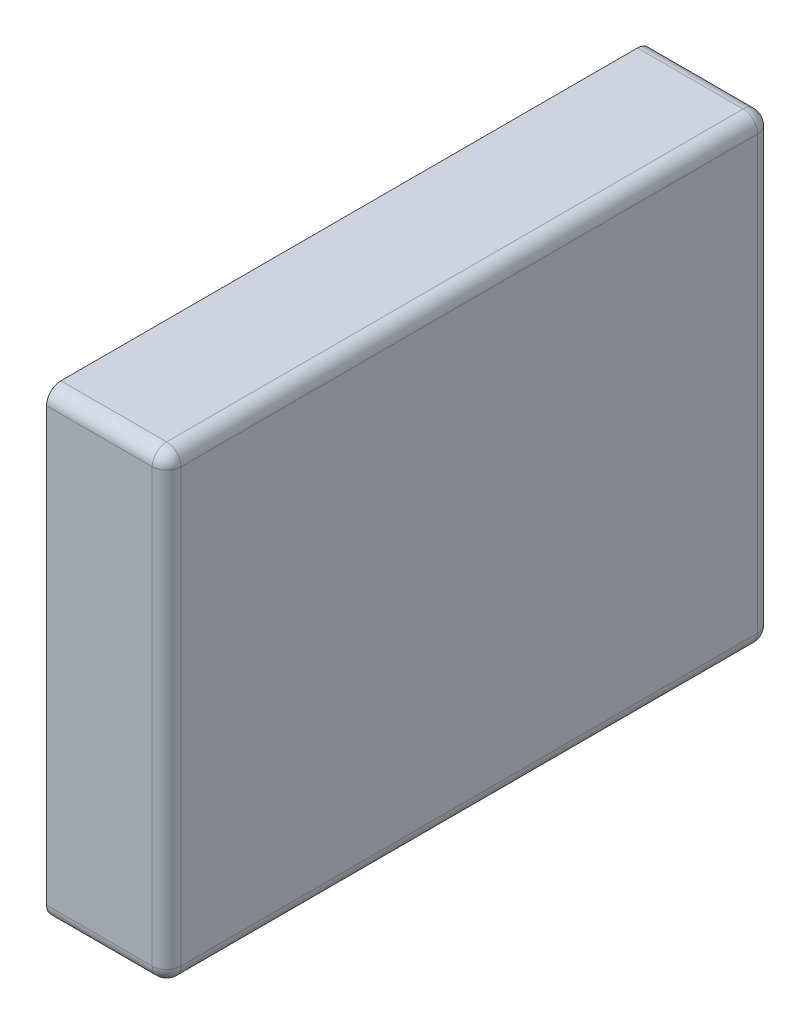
ISO-10303-21;
HEADER;
FILE_DESCRIPTION(('STEP AP214'),'2;1');
FILE_NAME('part.step','',(''),(''),'','','');
FILE_SCHEMA(('AUTOMOTIVE_DESIGN { 1 0 10303 214 1 1 1 1 }'));
ENDSEC;
DATA;
#1=APPLICATION_CONTEXT('core data for automotive mechanical design processes');
#2=APPLICATION_PROTOCOL_DEFINITION('international standard','automotive_design',2000,#1);
#3=PRODUCT_CONTEXT('',#1,'mechanical');
#4=PRODUCT('Part','Part','',(#3));
#5=PRODUCT_RELATED_PRODUCT_CATEGORY('part','',(#4));
#6=PRODUCT_DEFINITION_FORMATION('','',#4);
#7=PRODUCT_DEFINITION_CONTEXT('part definition',#1,'design');
#8=PRODUCT_DEFINITION('design','',#6,#7);
#9=PRODUCT_DEFINITION_SHAPE('','',#8);
#10=(LENGTH_UNIT() NAMED_UNIT(*) SI_UNIT(.MILLI.,.METRE.));
#11=(NAMED_UNIT(*) PLANE_ANGLE_UNIT() SI_UNIT($,.RADIAN.));
#12=(NAMED_UNIT(*) SI_UNIT($,.STERADIAN.) SOLID_ANGLE_UNIT());
#13=UNCERTAINTY_MEASURE_WITH_UNIT(LENGTH_MEASURE(1.E-05),#10,'distance_accuracy_value','');
#14=(GEOMETRIC_REPRESENTATION_CONTEXT(3) GLOBAL_UNCERTAINTY_ASSIGNED_CONTEXT((#13)) GLOBAL_UNIT_ASSIGNED_CONTEXT((#10,
#11,#12)) REPRESENTATION_CONTEXT('',''));
#15=CARTESIAN_POINT('',(0.,0.,0.));
#16=DIRECTION('',(0.,0.,1.));
#17=DIRECTION('',(1.,0.,0.));
#18=AXIS2_PLACEMENT_3D('',#15,#16,#17);
#19=CARTESIAN_POINT('',(25.,48.,-63.));
#20=DIRECTION('',(0.,0.,1.));
#21=DIRECTION('',(0.,-1.,0.));
#22=AXIS2_PLACEMENT_3D('',#19,#20,#21);
#23=PLANE('',#22);
#24=DIRECTION('',(0.,1.,0.));
#25=VECTOR('',#24,1.);
#26=CARTESIAN_POINT('',(22.,-45.,-63.));
#27=LINE('',#26,#25);
#28=CARTESIAN_POINT('',(22.,45.,-63.));
#29=VERTEX_POINT('',#28);
#30=CARTESIAN_POINT('',(22.,-45.,-63.));
#31=VERTEX_POINT('',#30);
#32=EDGE_CURVE('E273',#29,#31,#27,.F.);
#33=ORIENTED_EDGE('',*,*,#32,.T.);
#34=DIRECTION('',(-1.,0.,0.));
#35=VECTOR('',#34,1.);
#36=CARTESIAN_POINT('',(25.,-45.,-63.));
#37=LINE('',#36,#35);
#38=CARTESIAN_POINT('',(0.,-45.,-63.));
#39=VERTEX_POINT('',#38);
#40=EDGE_CURVE('E283',#31,#39,#37,.T.);
#41=ORIENTED_EDGE('',*,*,#40,.T.);
#42=DIRECTION('',(0.,1.,0.));
#43=VECTOR('',#42,1.);
#44=CARTESIAN_POINT('',(0.,48.,-63.));
#45=LINE('',#44,#43);
#46=CARTESIAN_POINT('',(0.,45.,-63.));
#47=VERTEX_POINT('',#46);
#48=EDGE_CURVE('E237',#39,#47,#45,.T.);
#49=ORIENTED_EDGE('',*,*,#48,.T.);
#50=DIRECTION('',(-1.,0.,0.));
#51=VECTOR('',#50,1.);
#52=CARTESIAN_POINT('',(25.,45.,-63.));
#53=LINE('',#52,#51);
#54=EDGE_CURVE('E281',#47,#29,#53,.F.);
#55=ORIENTED_EDGE('',*,*,#54,.T.);
#56=EDGE_LOOP('',(#33,#41,#49,#55));
#57=FACE_BOUND('',#56,.T.);
#58=ADVANCED_FACE('F35',(#57),#23,.F.);
#59=CARTESIAN_POINT('',(25.,48.,63.));
#60=DIRECTION('',(0.,-1.,0.));
#61=DIRECTION('',(0.,0.,-1.));
#62=AXIS2_PLACEMENT_3D('',#59,#60,#61);
#63=PLANE('',#62);
#64=DIRECTION('',(0.,0.,1.));
#65=VECTOR('',#64,1.);
#66=CARTESIAN_POINT('',(22.,48.,-63.));
#67=LINE('',#66,#65);
#68=CARTESIAN_POINT('',(22.,48.,60.));
#69=VERTEX_POINT('',#68);
#70=CARTESIAN_POINT('',(22.,48.,-60.));
#71=VERTEX_POINT('',#70);
#72=EDGE_CURVE('E247',#69,#71,#67,.F.);
#73=ORIENTED_EDGE('',*,*,#72,.T.);
#74=DIRECTION('',(-1.,0.,0.));
#75=VECTOR('',#74,1.);
#76=CARTESIAN_POINT('',(25.,48.,-60.));
#77=LINE('',#76,#75);
#78=CARTESIAN_POINT('',(0.,48.,-60.));
#79=VERTEX_POINT('',#78);
#80=EDGE_CURVE('E294',#71,#79,#77,.T.);
#81=ORIENTED_EDGE('',*,*,#80,.T.);
#82=DIRECTION('',(0.,0.,1.));
#83=VECTOR('',#82,1.);
#84=CARTESIAN_POINT('',(0.,48.,63.));
#85=LINE('',#84,#83);
#86=CARTESIAN_POINT('',(0.,48.,60.));
#87=VERTEX_POINT('',#86);
#88=EDGE_CURVE('E233',#79,#87,#85,.T.);
#89=ORIENTED_EDGE('',*,*,#88,.T.);
#90=DIRECTION('',(-1.,0.,0.));
#91=VECTOR('',#90,1.);
#92=CARTESIAN_POINT('',(25.,48.,60.));
#93=LINE('',#92,#91);
#94=EDGE_CURVE('E225',#87,#69,#93,.F.);
#95=ORIENTED_EDGE('',*,*,#94,.T.);
#96=EDGE_LOOP('',(#73,#81,#89,#95));
#97=FACE_BOUND('',#96,.T.);
#98=ADVANCED_FACE('F406',(#97),#63,.F.);
#99=CARTESIAN_POINT('',(25.,48.,63.));
#100=DIRECTION('',(0.,0.,-1.));
#101=DIRECTION('',(0.,1.,0.));
#102=AXIS2_PLACEMENT_3D('',#99,#100,#101);
#103=PLANE('',#102);
#104=DIRECTION('',(0.,-1.,0.));
#105=VECTOR('',#104,1.);
#106=CARTESIAN_POINT('',(0.,48.,63.));
#107=LINE('',#106,#105);
#108=CARTESIAN_POINT('',(0.,45.,63.));
#109=VERTEX_POINT('',#108);
#110=CARTESIAN_POINT('',(0.,-45.,63.));
#111=VERTEX_POINT('',#110);
#112=EDGE_CURVE('E212',#109,#111,#107,.T.);
#113=ORIENTED_EDGE('',*,*,#112,.T.);
#114=DIRECTION('',(-1.,0.,0.));
#115=VECTOR('',#114,1.);
#116=CARTESIAN_POINT('',(25.,-45.,63.));
#117=LINE('',#116,#115);
#118=CARTESIAN_POINT('',(22.,-45.,63.));
#119=VERTEX_POINT('',#118);
#120=EDGE_CURVE('E266',#111,#119,#117,.F.);
#121=ORIENTED_EDGE('',*,*,#120,.T.);
#122=DIRECTION('',(0.,-1.,0.));
#123=VECTOR('',#122,1.);
#124=CARTESIAN_POINT('',(22.,45.,63.));
#125=LINE('',#124,#123);
#126=CARTESIAN_POINT('',(22.,45.,63.));
#127=VERTEX_POINT('',#126);
#128=EDGE_CURVE('E215',#119,#127,#125,.F.);
#129=ORIENTED_EDGE('',*,*,#128,.T.);
#130=DIRECTION('',(-1.,0.,0.));
#131=VECTOR('',#130,1.);
#132=CARTESIAN_POINT('',(25.,45.,63.));
#133=LINE('',#132,#131);
#134=EDGE_CURVE('E208',#127,#109,#133,.T.);
#135=ORIENTED_EDGE('',*,*,#134,.T.);
#136=EDGE_LOOP('',(#113,#121,#129,#135));
#137=FACE_BOUND('',#136,.T.);
#138=ADVANCED_FACE('F210',(#137),#103,.F.);
#139=CARTESIAN_POINT('',(25.,-48.,63.));
#140=DIRECTION('',(0.,1.,0.));
#141=DIRECTION('',(0.,0.,1.));
#142=AXIS2_PLACEMENT_3D('',#139,#140,#141);
#143=PLANE('',#142);
#144=DIRECTION('',(0.,0.,-1.));
#145=VECTOR('',#144,1.);
#146=CARTESIAN_POINT('',(0.,-48.,63.));
#147=LINE('',#146,#145);
#148=CARTESIAN_POINT('',(0.,-48.,60.));
#149=VERTEX_POINT('',#148);
#150=CARTESIAN_POINT('',(0.,-48.,-60.));
#151=VERTEX_POINT('',#150);
#152=EDGE_CURVE('E219',#149,#151,#147,.T.);
#153=ORIENTED_EDGE('',*,*,#152,.T.);
#154=DIRECTION('',(-1.,0.,0.));
#155=VECTOR('',#154,1.);
#156=CARTESIAN_POINT('',(25.,-48.,-60.));
#157=LINE('',#156,#155);
#158=CARTESIAN_POINT('',(22.,-48.,-60.));
#159=VERTEX_POINT('',#158);
#160=EDGE_CURVE('E290',#151,#159,#157,.F.);
#161=ORIENTED_EDGE('',*,*,#160,.T.);
#162=DIRECTION('',(0.,0.,-1.));
#163=VECTOR('',#162,1.);
#164=CARTESIAN_POINT('',(22.,-48.,60.));
#165=LINE('',#164,#163);
#166=CARTESIAN_POINT('',(22.,-48.,60.));
#167=VERTEX_POINT('',#166);
#168=EDGE_CURVE('E253',#159,#167,#165,.F.);
#169=ORIENTED_EDGE('',*,*,#168,.T.);
#170=DIRECTION('',(-1.,0.,0.));
#171=VECTOR('',#170,1.);
#172=CARTESIAN_POINT('',(25.,-48.,60.));
#173=LINE('',#172,#171);
#174=EDGE_CURVE('E262',#167,#149,#173,.T.);
#175=ORIENTED_EDGE('',*,*,#174,.T.);
#176=EDGE_LOOP('',(#153,#161,#169,#175));
#177=FACE_BOUND('',#176,.T.);
#178=ADVANCED_FACE('F528',(#177),#143,.F.);
#179=CARTESIAN_POINT('',(25.,0.,0.));
#180=DIRECTION('',(1.,0.,0.));
#181=DIRECTION('',(0.,0.,-1.));
#182=AXIS2_PLACEMENT_3D('',#179,#180,#181);
#183=PLANE('',#182);
#184=DIRECTION('',(0.,0.,-1.));
#185=VECTOR('',#184,1.);
#186=CARTESIAN_POINT('',(25.,-45.,-63.));
#187=LINE('',#186,#185);
#188=CARTESIAN_POINT('',(25.,-45.,60.));
#189=VERTEX_POINT('',#188);
#190=CARTESIAN_POINT('',(25.,-45.,-60.));
#191=VERTEX_POINT('',#190);
#192=EDGE_CURVE('E270',#189,#191,#187,.T.);
#193=ORIENTED_EDGE('',*,*,#192,.T.);
#194=DIRECTION('',(0.,1.,0.));
#195=VECTOR('',#194,1.);
#196=CARTESIAN_POINT('',(25.,45.,-60.));
#197=LINE('',#196,#195);
#198=CARTESIAN_POINT('',(25.,45.,-60.));
#199=VERTEX_POINT('',#198);
#200=EDGE_CURVE('E298',#191,#199,#197,.T.);
#201=ORIENTED_EDGE('',*,*,#200,.T.);
#202=DIRECTION('',(0.,0.,1.));
#203=VECTOR('',#202,1.);
#204=CARTESIAN_POINT('',(25.,45.,60.));
#205=LINE('',#204,#203);
#206=CARTESIAN_POINT('',(25.,45.,60.));
#207=VERTEX_POINT('',#206);
#208=EDGE_CURVE('E245',#199,#207,#205,.T.);
#209=ORIENTED_EDGE('',*,*,#208,.T.);
#210=DIRECTION('',(0.,-1.,0.));
#211=VECTOR('',#210,1.);
#212=CARTESIAN_POINT('',(25.,-48.,60.));
#213=LINE('',#212,#211);
#214=EDGE_CURVE('E242',#207,#189,#213,.T.);
#215=ORIENTED_EDGE('',*,*,#214,.T.);
#216=EDGE_LOOP('',(#193,#201,#209,#215));
#217=FACE_BOUND('',#216,.T.);
#218=ADVANCED_FACE('F538',(#217),#183,.T.);
#219=CARTESIAN_POINT('',(0.,0.,0.));
#220=DIRECTION('',(1.,0.,0.));
#221=DIRECTION('',(0.,0.,-1.));
#222=AXIS2_PLACEMENT_3D('',#219,#220,#221);
#223=PLANE('',#222);
#224=DIRECTION('',(0.,0.,-1.));
#225=VECTOR('',#224,1.);
#226=CARTESIAN_POINT('',(0.,47.,-62.));
#227=LINE('',#226,#225);
#228=CARTESIAN_POINT('',(0.,47.,56.));
#229=VERTEX_POINT('',#228);
#230=CARTESIAN_POINT('',(0.,47.,-56.));
#231=VERTEX_POINT('',#230);
#232=EDGE_CURVE('E509',#229,#231,#227,.T.);
#233=ORIENTED_EDGE('',*,*,#232,.F.);
#234=CARTESIAN_POINT('',(0.,41.,56.));
#235=DIRECTION('',(1.,0.,0.));
#236=DIRECTION('',(0.,0.,-1.));
#237=AXIS2_PLACEMENT_3D('',#234,#235,#236);
#238=CIRCLE('',#237,6.);
#239=CARTESIAN_POINT('',(0.,41.,62.));
#240=VERTEX_POINT('',#239);
#241=EDGE_CURVE('E331',#229,#240,#238,.T.);
#242=ORIENTED_EDGE('',*,*,#241,.T.);
#243=DIRECTION('',(0.,1.,0.));
#244=VECTOR('',#243,1.);
#245=CARTESIAN_POINT('',(0.,47.,62.));
#246=LINE('',#245,#244);
#247=CARTESIAN_POINT('',(0.,-41.,62.));
#248=VERTEX_POINT('',#247);
#249=EDGE_CURVE('E507',#248,#240,#246,.T.);
#250=ORIENTED_EDGE('',*,*,#249,.F.);
#251=CARTESIAN_POINT('',(0.,-41.,56.));
#252=DIRECTION('',(1.,0.,0.));
#253=DIRECTION('',(0.,0.,-1.));
#254=AXIS2_PLACEMENT_3D('',#251,#252,#253);
#255=CIRCLE('',#254,6.);
#256=CARTESIAN_POINT('',(0.,-47.,56.));
#257=VERTEX_POINT('',#256);
#258=EDGE_CURVE('E371',#248,#257,#255,.T.);
#259=ORIENTED_EDGE('',*,*,#258,.T.);
#260=DIRECTION('',(0.,0.,1.));
#261=VECTOR('',#260,1.);
#262=CARTESIAN_POINT('',(0.,-47.,-62.));
#263=LINE('',#262,#261);
#264=CARTESIAN_POINT('',(0.,-47.,-56.));
#265=VERTEX_POINT('',#264);
#266=EDGE_CURVE('E496',#265,#257,#263,.T.);
#267=ORIENTED_EDGE('',*,*,#266,.F.);
#268=CARTESIAN_POINT('',(0.,-41.,-56.));
#269=DIRECTION('',(1.,0.,0.));
#270=DIRECTION('',(0.,0.,-1.));
#271=AXIS2_PLACEMENT_3D('',#268,#269,#270);
#272=CIRCLE('',#271,6.);
#273=CARTESIAN_POINT('',(0.,-41.,-62.));
#274=VERTEX_POINT('',#273);
#275=EDGE_CURVE('E11',#265,#274,#272,.T.);
#276=ORIENTED_EDGE('',*,*,#275,.T.);
#277=DIRECTION('',(0.,-1.,0.));
#278=VECTOR('',#277,1.);
#279=CARTESIAN_POINT('',(0.,47.,-62.));
#280=LINE('',#279,#278);
#281=CARTESIAN_POINT('',(0.,41.,-62.));
#282=VERTEX_POINT('',#281);
#283=EDGE_CURVE('E500',#282,#274,#280,.T.);
#284=ORIENTED_EDGE('',*,*,#283,.F.);
#285=CARTESIAN_POINT('',(0.,41.,-56.));
#286=DIRECTION('',(1.,0.,0.));
#287=DIRECTION('',(0.,0.,-1.));
#288=AXIS2_PLACEMENT_3D('',#285,#286,#287);
#289=CIRCLE('',#288,6.);
#290=EDGE_CURVE('E350',#282,#231,#289,.T.);
#291=ORIENTED_EDGE('',*,*,#290,.T.);
#292=EDGE_LOOP('',(#233,#242,#250,#259,#267,#276,#284,#291));
#293=FACE_BOUND('',#292,.T.);
#294=ORIENTED_EDGE('',*,*,#48,.F.);
#295=CARTESIAN_POINT('',(0.,-45.,-60.));
#296=DIRECTION('',(1.,0.,0.));
#297=DIRECTION('',(0.,0.,-1.));
#298=AXIS2_PLACEMENT_3D('',#295,#296,#297);
#299=CIRCLE('',#298,3.);
#300=EDGE_CURVE('E288',#39,#151,#299,.F.);
#301=ORIENTED_EDGE('',*,*,#300,.T.);
#302=ORIENTED_EDGE('',*,*,#152,.F.);
#303=CARTESIAN_POINT('',(0.,-45.,60.));
#304=DIRECTION('',(1.,0.,0.));
#305=DIRECTION('',(0.,0.,-1.));
#306=AXIS2_PLACEMENT_3D('',#303,#304,#305);
#307=CIRCLE('',#306,3.);
#308=EDGE_CURVE('E232',#149,#111,#307,.F.);
#309=ORIENTED_EDGE('',*,*,#308,.T.);
#310=ORIENTED_EDGE('',*,*,#112,.F.);
#311=CARTESIAN_POINT('',(0.,45.,60.));
#312=DIRECTION('',(1.,0.,0.));
#313=DIRECTION('',(0.,0.,-1.));
#314=AXIS2_PLACEMENT_3D('',#311,#312,#313);
#315=CIRCLE('',#314,3.);
#316=EDGE_CURVE('E218',#109,#87,#315,.F.);
#317=ORIENTED_EDGE('',*,*,#316,.T.);
#318=ORIENTED_EDGE('',*,*,#88,.F.);
#319=CARTESIAN_POINT('',(0.,45.,-60.));
#320=DIRECTION('',(1.,0.,0.));
#321=DIRECTION('',(0.,0.,-1.));
#322=AXIS2_PLACEMENT_3D('',#319,#320,#321);
#323=CIRCLE('',#322,3.);
#324=EDGE_CURVE('E286',#79,#47,#323,.F.);
#325=ORIENTED_EDGE('',*,*,#324,.T.);
#326=EDGE_LOOP('',(#294,#301,#302,#309,#310,#317,#318,#325));
#327=FACE_BOUND('',#326,.T.);
#328=ADVANCED_FACE('F230',(#293,#327),#223,.F.);
#329=CARTESIAN_POINT('',(25.,45.,60.));
#330=DIRECTION('',(-1.,0.,0.));
#331=DIRECTION('',(0.,0.,1.));
#332=AXIS2_PLACEMENT_3D('',#329,#330,#331);
#333=CYLINDRICAL_SURFACE('',#332,3.);
#334=ORIENTED_EDGE('',*,*,#134,.F.);
#335=CARTESIAN_POINT('',(22.,45.,60.));
#336=DIRECTION('',(-1.,0.,0.));
#337=DIRECTION('',(0.,0.,1.));
#338=AXIS2_PLACEMENT_3D('',#335,#336,#337);
#339=CIRCLE('',#338,3.);
#340=EDGE_CURVE('E250',#127,#69,#339,.T.);
#341=ORIENTED_EDGE('',*,*,#340,.T.);
#342=ORIENTED_EDGE('',*,*,#94,.F.);
#343=ORIENTED_EDGE('',*,*,#316,.F.);
#344=EDGE_LOOP('',(#334,#341,#342,#343));
#345=FACE_BOUND('',#344,.T.);
#346=ADVANCED_FACE('F223',(#345),#333,.T.);
#347=CARTESIAN_POINT('',(22.,0.,60.));
#348=DIRECTION('',(0.,1.,0.));
#349=DIRECTION('',(0.,0.,1.));
#350=AXIS2_PLACEMENT_3D('',#347,#348,#349);
#351=CYLINDRICAL_SURFACE('',#350,3.);
#352=ORIENTED_EDGE('',*,*,#128,.F.);
#353=CARTESIAN_POINT('',(22.,-45.,60.));
#354=DIRECTION('',(0.,1.,0.));
#355=DIRECTION('',(0.,0.,1.));
#356=AXIS2_PLACEMENT_3D('',#353,#354,#355);
#357=CIRCLE('',#356,3.);
#358=EDGE_CURVE('E268',#119,#189,#357,.T.);
#359=ORIENTED_EDGE('',*,*,#358,.T.);
#360=ORIENTED_EDGE('',*,*,#214,.F.);
#361=CARTESIAN_POINT('',(22.,45.,60.));
#362=DIRECTION('',(0.,1.,0.));
#363=DIRECTION('',(0.,0.,1.));
#364=AXIS2_PLACEMENT_3D('',#361,#362,#363);
#365=CIRCLE('',#364,3.);
#366=EDGE_CURVE('E257',#127,#207,#365,.T.);
#367=ORIENTED_EDGE('',*,*,#366,.F.);
#368=EDGE_LOOP('',(#352,#359,#360,#367));
#369=FACE_BOUND('',#368,.T.);
#370=ADVANCED_FACE('F418',(#369),#351,.T.);
#371=CARTESIAN_POINT('',(22.,45.,60.));
#372=DIRECTION('',(0.,0.,1.));
#373=DIRECTION('',(1.,0.,0.));
#374=AXIS2_PLACEMENT_3D('',#371,#372,#373);
#375=SPHERICAL_SURFACE('',#374,3.);
#376=ORIENTED_EDGE('',*,*,#340,.F.);
#377=ORIENTED_EDGE('',*,*,#366,.T.);
#378=CARTESIAN_POINT('',(22.,45.,60.));
#379=DIRECTION('',(0.,0.,-1.));
#380=DIRECTION('',(-1.,0.,0.));
#381=AXIS2_PLACEMENT_3D('',#378,#379,#380);
#382=CIRCLE('',#381,3.);
#383=EDGE_CURVE('E254',#69,#207,#382,.T.);
#384=ORIENTED_EDGE('',*,*,#383,.F.);
#385=EDGE_LOOP('',(#376,#377,#384));
#386=FACE_BOUND('',#385,.T.);
#387=ADVANCED_FACE('F423',(#386),#375,.T.);
#388=CARTESIAN_POINT('',(22.,45.,0.));
#389=DIRECTION('',(0.,0.,-1.));
#390=DIRECTION('',(-1.,0.,0.));
#391=AXIS2_PLACEMENT_3D('',#388,#389,#390);
#392=CYLINDRICAL_SURFACE('',#391,3.);
#393=ORIENTED_EDGE('',*,*,#208,.F.);
#394=CARTESIAN_POINT('',(22.,45.,-60.));
#395=DIRECTION('',(0.,0.,-1.));
#396=DIRECTION('',(-1.,0.,0.));
#397=AXIS2_PLACEMENT_3D('',#394,#395,#396);
#398=CIRCLE('',#397,3.);
#399=EDGE_CURVE('E296',#199,#71,#398,.F.);
#400=ORIENTED_EDGE('',*,*,#399,.T.);
#401=ORIENTED_EDGE('',*,*,#72,.F.);
#402=ORIENTED_EDGE('',*,*,#383,.T.);
#403=EDGE_LOOP('',(#393,#400,#401,#402));
#404=FACE_BOUND('',#403,.T.);
#405=ADVANCED_FACE('F419',(#404),#392,.T.);
#406=CARTESIAN_POINT('',(22.,-45.,0.));
#407=DIRECTION('',(0.,0.,1.));
#408=DIRECTION('',(1.,0.,0.));
#409=AXIS2_PLACEMENT_3D('',#406,#407,#408);
#410=CYLINDRICAL_SURFACE('',#409,3.);
#411=ORIENTED_EDGE('',*,*,#168,.F.);
#412=CARTESIAN_POINT('',(22.,-45.,-60.));
#413=DIRECTION('',(0.,0.,1.));
#414=DIRECTION('',(1.,0.,0.));
#415=AXIS2_PLACEMENT_3D('',#412,#413,#414);
#416=CIRCLE('',#415,3.);
#417=EDGE_CURVE('E292',#159,#191,#416,.T.);
#418=ORIENTED_EDGE('',*,*,#417,.T.);
#419=ORIENTED_EDGE('',*,*,#192,.F.);
#420=CARTESIAN_POINT('',(22.,-45.,60.));
#421=DIRECTION('',(0.,0.,1.));
#422=DIRECTION('',(1.,0.,0.));
#423=AXIS2_PLACEMENT_3D('',#420,#421,#422);
#424=CIRCLE('',#423,3.);
#425=EDGE_CURVE('E258',#167,#189,#424,.T.);
#426=ORIENTED_EDGE('',*,*,#425,.F.);
#427=EDGE_LOOP('',(#411,#418,#419,#426));
#428=FACE_BOUND('',#427,.T.);
#429=ADVANCED_FACE('F422',(#428),#410,.T.);
#430=CARTESIAN_POINT('',(22.,-45.,60.));
#431=DIRECTION('',(0.,0.,1.));
#432=DIRECTION('',(1.,0.,0.));
#433=AXIS2_PLACEMENT_3D('',#430,#431,#432);
#434=SPHERICAL_SURFACE('',#433,3.);
#435=ORIENTED_EDGE('',*,*,#425,.T.);
#436=ORIENTED_EDGE('',*,*,#358,.F.);
#437=CARTESIAN_POINT('',(22.,-45.,60.));
#438=DIRECTION('',(-1.,0.,0.));
#439=DIRECTION('',(0.,0.,1.));
#440=AXIS2_PLACEMENT_3D('',#437,#438,#439);
#441=CIRCLE('',#440,3.);
#442=EDGE_CURVE('E274',#167,#119,#441,.T.);
#443=ORIENTED_EDGE('',*,*,#442,.F.);
#444=EDGE_LOOP('',(#435,#436,#443));
#445=FACE_BOUND('',#444,.T.);
#446=ADVANCED_FACE('F435',(#445),#434,.T.);
#447=CARTESIAN_POINT('',(25.,-45.,60.));
#448=DIRECTION('',(-1.,0.,0.));
#449=DIRECTION('',(0.,0.,1.));
#450=AXIS2_PLACEMENT_3D('',#447,#448,#449);
#451=CYLINDRICAL_SURFACE('',#450,3.);
#452=ORIENTED_EDGE('',*,*,#442,.T.);
#453=ORIENTED_EDGE('',*,*,#120,.F.);
#454=ORIENTED_EDGE('',*,*,#308,.F.);
#455=ORIENTED_EDGE('',*,*,#174,.F.);
#456=EDGE_LOOP('',(#452,#453,#454,#455));
#457=FACE_BOUND('',#456,.T.);
#458=ADVANCED_FACE('F431',(#457),#451,.T.);
#459=CARTESIAN_POINT('',(25.,45.,-60.));
#460=DIRECTION('',(-1.,0.,0.));
#461=DIRECTION('',(0.,0.,1.));
#462=AXIS2_PLACEMENT_3D('',#459,#460,#461);
#463=CYLINDRICAL_SURFACE('',#462,3.);
#464=ORIENTED_EDGE('',*,*,#324,.F.);
#465=ORIENTED_EDGE('',*,*,#80,.F.);
#466=CARTESIAN_POINT('',(22.,45.,-60.));
#467=DIRECTION('',(1.,0.,0.));
#468=DIRECTION('',(0.,0.,-1.));
#469=AXIS2_PLACEMENT_3D('',#466,#467,#468);
#470=CIRCLE('',#469,3.);
#471=EDGE_CURVE('E277',#29,#71,#470,.T.);
#472=ORIENTED_EDGE('',*,*,#471,.F.);
#473=ORIENTED_EDGE('',*,*,#54,.F.);
#474=EDGE_LOOP('',(#464,#465,#472,#473));
#475=FACE_BOUND('',#474,.T.);
#476=ADVANCED_FACE('F434',(#475),#463,.T.);
#477=CARTESIAN_POINT('',(22.,45.,-60.));
#478=DIRECTION('',(0.,0.,1.));
#479=DIRECTION('',(1.,0.,0.));
#480=AXIS2_PLACEMENT_3D('',#477,#478,#479);
#481=SPHERICAL_SURFACE('',#480,3.);
#482=ORIENTED_EDGE('',*,*,#471,.T.);
#483=ORIENTED_EDGE('',*,*,#399,.F.);
#484=CARTESIAN_POINT('',(22.,45.,-60.));
#485=DIRECTION('',(0.,-1.,0.));
#486=DIRECTION('',(0.,0.,-1.));
#487=AXIS2_PLACEMENT_3D('',#484,#485,#486);
#488=CIRCLE('',#487,3.);
#489=EDGE_CURVE('E308',#29,#199,#488,.T.);
#490=ORIENTED_EDGE('',*,*,#489,.F.);
#491=EDGE_LOOP('',(#482,#483,#490));
#492=FACE_BOUND('',#491,.T.);
#493=ADVANCED_FACE('F455',(#492),#481,.T.);
#494=CARTESIAN_POINT('',(22.,0.,-60.));
#495=DIRECTION('',(0.,-1.,0.));
#496=DIRECTION('',(0.,0.,-1.));
#497=AXIS2_PLACEMENT_3D('',#494,#495,#496);
#498=CYLINDRICAL_SURFACE('',#497,3.);
#499=ORIENTED_EDGE('',*,*,#489,.T.);
#500=ORIENTED_EDGE('',*,*,#200,.F.);
#501=CARTESIAN_POINT('',(22.,-45.,-60.));
#502=DIRECTION('',(0.,-1.,0.));
#503=DIRECTION('',(0.,0.,-1.));
#504=AXIS2_PLACEMENT_3D('',#501,#502,#503);
#505=CIRCLE('',#504,3.);
#506=EDGE_CURVE('E304',#31,#191,#505,.T.);
#507=ORIENTED_EDGE('',*,*,#506,.F.);
#508=ORIENTED_EDGE('',*,*,#32,.F.);
#509=EDGE_LOOP('',(#499,#500,#507,#508));
#510=FACE_BOUND('',#509,.T.);
#511=ADVANCED_FACE('F451',(#510),#498,.T.);
#512=CARTESIAN_POINT('',(22.,-45.,-60.));
#513=DIRECTION('',(0.,0.,1.));
#514=DIRECTION('',(1.,0.,0.));
#515=AXIS2_PLACEMENT_3D('',#512,#513,#514);
#516=SPHERICAL_SURFACE('',#515,3.);
#517=ORIENTED_EDGE('',*,*,#506,.T.);
#518=ORIENTED_EDGE('',*,*,#417,.F.);
#519=CARTESIAN_POINT('',(22.,-45.,-60.));
#520=DIRECTION('',(-1.,0.,0.));
#521=DIRECTION('',(0.,0.,1.));
#522=AXIS2_PLACEMENT_3D('',#519,#520,#521);
#523=CIRCLE('',#522,3.);
#524=EDGE_CURVE('E301',#31,#159,#523,.T.);
#525=ORIENTED_EDGE('',*,*,#524,.F.);
#526=EDGE_LOOP('',(#517,#518,#525));
#527=FACE_BOUND('',#526,.T.);
#528=ADVANCED_FACE('F447',(#527),#516,.T.);
#529=CARTESIAN_POINT('',(25.,-45.,-60.));
#530=DIRECTION('',(-1.,0.,0.));
#531=DIRECTION('',(0.,0.,1.));
#532=AXIS2_PLACEMENT_3D('',#529,#530,#531);
#533=CYLINDRICAL_SURFACE('',#532,3.);
#534=ORIENTED_EDGE('',*,*,#524,.T.);
#535=ORIENTED_EDGE('',*,*,#160,.F.);
#536=ORIENTED_EDGE('',*,*,#300,.F.);
#537=ORIENTED_EDGE('',*,*,#40,.F.);
#538=EDGE_LOOP('',(#534,#535,#536,#537));
#539=FACE_BOUND('',#538,.T.);
#540=ADVANCED_FACE('F443',(#539),#533,.T.);
#541=CARTESIAN_POINT('',(1.,47.,62.));
#542=DIRECTION('',(0.,0.,1.));
#543=DIRECTION('',(1.,0.,0.));
#544=AXIS2_PLACEMENT_3D('',#541,#542,#543);
#545=PLANE('',#544);
#546=DIRECTION('',(0.,1.,0.));
#547=VECTOR('',#546,1.);
#548=CARTESIAN_POINT('',(1.,47.,62.));
#549=LINE('',#548,#547);
#550=CARTESIAN_POINT('',(1.,-41.,62.));
#551=VERTEX_POINT('',#550);
#552=CARTESIAN_POINT('',(1.,41.,62.));
#553=VERTEX_POINT('',#552);
#554=EDGE_CURVE('E490',#551,#553,#549,.T.);
#555=ORIENTED_EDGE('',*,*,#554,.F.);
#556=DIRECTION('',(-1.,0.,0.));
#557=VECTOR('',#556,1.);
#558=CARTESIAN_POINT('',(0.,-41.,62.));
#559=LINE('',#558,#557);
#560=EDGE_CURVE('E363',#551,#248,#559,.T.);
#561=ORIENTED_EDGE('',*,*,#560,.T.);
#562=ORIENTED_EDGE('',*,*,#249,.T.);
#563=DIRECTION('',(-1.,0.,0.));
#564=VECTOR('',#563,1.);
#565=CARTESIAN_POINT('',(1.,41.,62.));
#566=LINE('',#565,#564);
#567=EDGE_CURVE('E326',#240,#553,#566,.F.);
#568=ORIENTED_EDGE('',*,*,#567,.T.);
#569=EDGE_LOOP('',(#555,#561,#562,#568));
#570=FACE_BOUND('',#569,.T.);
#571=ADVANCED_FACE('F446',(#570),#545,.F.);
#572=CARTESIAN_POINT('',(1.,-47.,-62.));
#573=DIRECTION('',(0.,-1.,0.));
#574=DIRECTION('',(0.,0.,-1.));
#575=AXIS2_PLACEMENT_3D('',#572,#573,#574);
#576=PLANE('',#575);
#577=DIRECTION('',(0.,0.,1.));
#578=VECTOR('',#577,1.);
#579=CARTESIAN_POINT('',(1.,-47.,-62.));
#580=LINE('',#579,#578);
#581=CARTESIAN_POINT('',(1.,-47.,-56.));
#582=VERTEX_POINT('',#581);
#583=CARTESIAN_POINT('',(1.,-47.,56.));
#584=VERTEX_POINT('',#583);
#585=EDGE_CURVE('E305',#582,#584,#580,.T.);
#586=ORIENTED_EDGE('',*,*,#585,.F.);
#587=DIRECTION('',(-1.,0.,0.));
#588=VECTOR('',#587,1.);
#589=CARTESIAN_POINT('',(0.,-47.,-56.));
#590=LINE('',#589,#588);
#591=EDGE_CURVE('E383',#582,#265,#590,.T.);
#592=ORIENTED_EDGE('',*,*,#591,.T.);
#593=ORIENTED_EDGE('',*,*,#266,.T.);
#594=DIRECTION('',(-1.,0.,0.));
#595=VECTOR('',#594,1.);
#596=CARTESIAN_POINT('',(1.,-47.,56.));
#597=LINE('',#596,#595);
#598=EDGE_CURVE('E366',#257,#584,#597,.F.);
#599=ORIENTED_EDGE('',*,*,#598,.T.);
#600=EDGE_LOOP('',(#586,#592,#593,#599));
#601=FACE_BOUND('',#600,.T.);
#602=ADVANCED_FACE('F394',(#601),#576,.F.);
#603=CARTESIAN_POINT('',(1.,47.,-62.));
#604=DIRECTION('',(0.,0.,-1.));
#605=DIRECTION('',(-1.,0.,0.));
#606=AXIS2_PLACEMENT_3D('',#603,#604,#605);
#607=PLANE('',#606);
#608=ORIENTED_EDGE('',*,*,#283,.T.);
#609=DIRECTION('',(-1.,0.,0.));
#610=VECTOR('',#609,1.);
#611=CARTESIAN_POINT('',(1.,-41.,-62.));
#612=LINE('',#611,#610);
#613=CARTESIAN_POINT('',(1.,-41.,-62.));
#614=VERTEX_POINT('',#613);
#615=EDGE_CURVE('E55',#274,#614,#612,.F.);
#616=ORIENTED_EDGE('',*,*,#615,.T.);
#617=DIRECTION('',(0.,-1.,0.));
#618=VECTOR('',#617,1.);
#619=CARTESIAN_POINT('',(1.,47.,-62.));
#620=LINE('',#619,#618);
#621=CARTESIAN_POINT('',(1.,41.,-62.));
#622=VERTEX_POINT('',#621);
#623=EDGE_CURVE('E390',#622,#614,#620,.T.);
#624=ORIENTED_EDGE('',*,*,#623,.F.);
#625=DIRECTION('',(-1.,0.,0.));
#626=VECTOR('',#625,1.);
#627=CARTESIAN_POINT('',(0.,41.,-62.));
#628=LINE('',#627,#626);
#629=EDGE_CURVE('E343',#622,#282,#628,.T.);
#630=ORIENTED_EDGE('',*,*,#629,.T.);
#631=EDGE_LOOP('',(#608,#616,#624,#630));
#632=FACE_BOUND('',#631,.T.);
#633=ADVANCED_FACE('F663',(#632),#607,.F.);
#634=CARTESIAN_POINT('',(1.,47.,-62.));
#635=DIRECTION('',(0.,1.,0.));
#636=DIRECTION('',(0.,0.,1.));
#637=AXIS2_PLACEMENT_3D('',#634,#635,#636);
#638=PLANE('',#637);
#639=ORIENTED_EDGE('',*,*,#232,.T.);
#640=DIRECTION('',(-1.,0.,0.));
#641=VECTOR('',#640,1.);
#642=CARTESIAN_POINT('',(1.,47.,-56.));
#643=LINE('',#642,#641);
#644=CARTESIAN_POINT('',(1.,47.,-56.));
#645=VERTEX_POINT('',#644);
#646=EDGE_CURVE('E346',#231,#645,#643,.F.);
#647=ORIENTED_EDGE('',*,*,#646,.T.);
#648=DIRECTION('',(0.,0.,-1.));
#649=VECTOR('',#648,1.);
#650=CARTESIAN_POINT('',(1.,47.,-62.));
#651=LINE('',#650,#649);
#652=CARTESIAN_POINT('',(1.,47.,56.));
#653=VERTEX_POINT('',#652);
#654=EDGE_CURVE('E495',#653,#645,#651,.T.);
#655=ORIENTED_EDGE('',*,*,#654,.F.);
#656=DIRECTION('',(-1.,0.,0.));
#657=VECTOR('',#656,1.);
#658=CARTESIAN_POINT('',(0.,47.,56.));
#659=LINE('',#658,#657);
#660=EDGE_CURVE('E323',#653,#229,#659,.T.);
#661=ORIENTED_EDGE('',*,*,#660,.T.);
#662=EDGE_LOOP('',(#639,#647,#655,#661));
#663=FACE_BOUND('',#662,.T.);
#664=ADVANCED_FACE('F658',(#663),#638,.F.);
#665=CARTESIAN_POINT('',(1.,0.,0.));
#666=DIRECTION('',(-1.,0.,0.));
#667=DIRECTION('',(0.,0.,1.));
#668=AXIS2_PLACEMENT_3D('',#665,#666,#667);
#669=PLANE('',#668);
#670=DIRECTION('',(0.,1.,0.));
#671=VECTOR('',#670,1.);
#672=CARTESIAN_POINT('',(1.,46.,61.));
#673=LINE('',#672,#671);
#674=CARTESIAN_POINT('',(1.,-40.,61.));
#675=VERTEX_POINT('',#674);
#676=CARTESIAN_POINT('',(1.,40.,61.));
#677=VERTEX_POINT('',#676);
#678=EDGE_CURVE('E763',#675,#677,#673,.T.);
#679=ORIENTED_EDGE('',*,*,#678,.F.);
#680=CARTESIAN_POINT('',(1.,-40.,55.));
#681=DIRECTION('',(-1.,0.,0.));
#682=DIRECTION('',(0.,0.,1.));
#683=AXIS2_PLACEMENT_3D('',#680,#681,#682);
#684=CIRCLE('',#683,6.);
#685=CARTESIAN_POINT('',(1.,-46.,55.));
#686=VERTEX_POINT('',#685);
#687=EDGE_CURVE('E360',#675,#686,#684,.F.);
#688=ORIENTED_EDGE('',*,*,#687,.T.);
#689=DIRECTION('',(0.,0.,1.));
#690=VECTOR('',#689,1.);
#691=CARTESIAN_POINT('',(1.,-46.,-61.));
#692=LINE('',#691,#690);
#693=CARTESIAN_POINT('',(1.,-46.,-55.));
#694=VERTEX_POINT('',#693);
#695=EDGE_CURVE('E503',#694,#686,#692,.T.);
#696=ORIENTED_EDGE('',*,*,#695,.F.);
#697=CARTESIAN_POINT('',(1.,-40.,-55.));
#698=DIRECTION('',(-1.,0.,0.));
#699=DIRECTION('',(0.,0.,1.));
#700=AXIS2_PLACEMENT_3D('',#697,#698,#699);
#701=CIRCLE('',#700,6.);
#702=CARTESIAN_POINT('',(1.,-40.,-61.));
#703=VERTEX_POINT('',#702);
#704=EDGE_CURVE('E381',#694,#703,#701,.F.);
#705=ORIENTED_EDGE('',*,*,#704,.T.);
#706=DIRECTION('',(0.,-1.,0.));
#707=VECTOR('',#706,1.);
#708=CARTESIAN_POINT('',(1.,46.,-61.));
#709=LINE('',#708,#707);
#710=CARTESIAN_POINT('',(1.,40.,-61.));
#711=VERTEX_POINT('',#710);
#712=EDGE_CURVE('E771',#711,#703,#709,.T.);
#713=ORIENTED_EDGE('',*,*,#712,.F.);
#714=CARTESIAN_POINT('',(1.,40.,-55.));
#715=DIRECTION('',(-1.,0.,0.));
#716=DIRECTION('',(0.,0.,1.));
#717=AXIS2_PLACEMENT_3D('',#714,#715,#716);
#718=CIRCLE('',#717,6.);
#719=CARTESIAN_POINT('',(1.,46.,-55.));
#720=VERTEX_POINT('',#719);
#721=EDGE_CURVE('E341',#711,#720,#718,.F.);
#722=ORIENTED_EDGE('',*,*,#721,.T.);
#723=DIRECTION('',(0.,0.,-1.));
#724=VECTOR('',#723,1.);
#725=CARTESIAN_POINT('',(1.,46.,-61.));
#726=LINE('',#725,#724);
#727=CARTESIAN_POINT('',(1.,46.,55.));
#728=VERTEX_POINT('',#727);
#729=EDGE_CURVE('E768',#728,#720,#726,.T.);
#730=ORIENTED_EDGE('',*,*,#729,.F.);
#731=CARTESIAN_POINT('',(1.,40.,55.));
#732=DIRECTION('',(-1.,0.,0.));
#733=DIRECTION('',(0.,0.,1.));
#734=AXIS2_PLACEMENT_3D('',#731,#732,#733);
#735=CIRCLE('',#734,6.);
#736=EDGE_CURVE('E320',#728,#677,#735,.F.);
#737=ORIENTED_EDGE('',*,*,#736,.T.);
#738=EDGE_LOOP('',(#679,#688,#696,#705,#713,#722,#730,#737));
#739=FACE_BOUND('',#738,.T.);
#740=ORIENTED_EDGE('',*,*,#623,.T.);
#741=CARTESIAN_POINT('',(1.,-41.,-56.));
#742=DIRECTION('',(-1.,0.,0.));
#743=DIRECTION('',(0.,0.,1.));
#744=AXIS2_PLACEMENT_3D('',#741,#742,#743);
#745=CIRCLE('',#744,6.);
#746=EDGE_CURVE('E43',#614,#582,#745,.T.);
#747=ORIENTED_EDGE('',*,*,#746,.T.);
#748=ORIENTED_EDGE('',*,*,#585,.T.);
#749=CARTESIAN_POINT('',(1.,-41.,56.));
#750=DIRECTION('',(-1.,0.,0.));
#751=DIRECTION('',(0.,0.,1.));
#752=AXIS2_PLACEMENT_3D('',#749,#750,#751);
#753=CIRCLE('',#752,6.);
#754=EDGE_CURVE('E369',#584,#551,#753,.T.);
#755=ORIENTED_EDGE('',*,*,#754,.T.);
#756=ORIENTED_EDGE('',*,*,#554,.T.);
#757=CARTESIAN_POINT('',(1.,41.,56.));
#758=DIRECTION('',(-1.,0.,0.));
#759=DIRECTION('',(0.,0.,1.));
#760=AXIS2_PLACEMENT_3D('',#757,#758,#759);
#761=CIRCLE('',#760,6.);
#762=EDGE_CURVE('E329',#553,#653,#761,.T.);
#763=ORIENTED_EDGE('',*,*,#762,.T.);
#764=ORIENTED_EDGE('',*,*,#654,.T.);
#765=CARTESIAN_POINT('',(1.,41.,-56.));
#766=DIRECTION('',(-1.,0.,0.));
#767=DIRECTION('',(0.,0.,1.));
#768=AXIS2_PLACEMENT_3D('',#765,#766,#767);
#769=CIRCLE('',#768,6.);
#770=EDGE_CURVE('E348',#645,#622,#769,.T.);
#771=ORIENTED_EDGE('',*,*,#770,.T.);
#772=EDGE_LOOP('',(#740,#747,#748,#755,#756,#763,#764,#771));
#773=FACE_BOUND('',#772,.T.);
#774=ADVANCED_FACE('F389',(#739,#773),#669,.T.);
#775=CARTESIAN_POINT('',(21.,46.,61.));
#776=DIRECTION('',(0.,0.,1.));
#777=DIRECTION('',(1.,0.,0.));
#778=AXIS2_PLACEMENT_3D('',#775,#776,#777);
#779=PLANE('',#778);
#780=DIRECTION('',(0.,1.,0.));
#781=VECTOR('',#780,1.);
#782=CARTESIAN_POINT('',(21.,46.,61.));
#783=LINE('',#782,#781);
#784=CARTESIAN_POINT('',(21.,-40.,61.));
#785=VERTEX_POINT('',#784);
#786=CARTESIAN_POINT('',(21.,40.,61.));
#787=VERTEX_POINT('',#786);
#788=EDGE_CURVE('E778',#785,#787,#783,.T.);
#789=ORIENTED_EDGE('',*,*,#788,.F.);
#790=DIRECTION('',(-1.,0.,0.));
#791=VECTOR('',#790,1.);
#792=CARTESIAN_POINT('',(1.,-40.,61.));
#793=LINE('',#792,#791);
#794=EDGE_CURVE('E352',#785,#675,#793,.T.);
#795=ORIENTED_EDGE('',*,*,#794,.T.);
#796=ORIENTED_EDGE('',*,*,#678,.T.);
#797=DIRECTION('',(-1.,0.,0.));
#798=VECTOR('',#797,1.);
#799=CARTESIAN_POINT('',(21.,40.,61.));
#800=LINE('',#799,#798);
#801=EDGE_CURVE('E315',#677,#787,#800,.F.);
#802=ORIENTED_EDGE('',*,*,#801,.T.);
#803=EDGE_LOOP('',(#789,#795,#796,#802));
#804=FACE_BOUND('',#803,.T.);
#805=ADVANCED_FACE('F678',(#804),#779,.F.);
#806=CARTESIAN_POINT('',(21.,-46.,-61.));
#807=DIRECTION('',(0.,-1.,0.));
#808=DIRECTION('',(0.,0.,-1.));
#809=AXIS2_PLACEMENT_3D('',#806,#807,#808);
#810=PLANE('',#809);
#811=DIRECTION('',(0.,0.,1.));
#812=VECTOR('',#811,1.);
#813=CARTESIAN_POINT('',(21.,-46.,-61.));
#814=LINE('',#813,#812);
#815=CARTESIAN_POINT('',(21.,-46.,-55.));
#816=VERTEX_POINT('',#815);
#817=CARTESIAN_POINT('',(21.,-46.,55.));
#818=VERTEX_POINT('',#817);
#819=EDGE_CURVE('E510',#816,#818,#814,.T.);
#820=ORIENTED_EDGE('',*,*,#819,.F.);
#821=DIRECTION('',(-1.,0.,0.));
#822=VECTOR('',#821,1.);
#823=CARTESIAN_POINT('',(1.,-46.,-55.));
#824=LINE('',#823,#822);
#825=EDGE_CURVE('E374',#816,#694,#824,.T.);
#826=ORIENTED_EDGE('',*,*,#825,.T.);
#827=ORIENTED_EDGE('',*,*,#695,.T.);
#828=DIRECTION('',(-1.,0.,0.));
#829=VECTOR('',#828,1.);
#830=CARTESIAN_POINT('',(21.,-46.,55.));
#831=LINE('',#830,#829);
#832=EDGE_CURVE('E355',#686,#818,#831,.F.);
#833=ORIENTED_EDGE('',*,*,#832,.T.);
#834=EDGE_LOOP('',(#820,#826,#827,#833));
#835=FACE_BOUND('',#834,.T.);
#836=ADVANCED_FACE('F683',(#835),#810,.F.);
#837=CARTESIAN_POINT('',(21.,46.,-61.));
#838=DIRECTION('',(0.,0.,-1.));
#839=DIRECTION('',(-1.,0.,0.));
#840=AXIS2_PLACEMENT_3D('',#837,#838,#839);
#841=PLANE('',#840);
#842=ORIENTED_EDGE('',*,*,#712,.T.);
#843=DIRECTION('',(-1.,0.,0.));
#844=VECTOR('',#843,1.);
#845=CARTESIAN_POINT('',(21.,-40.,-61.));
#846=LINE('',#845,#844);
#847=CARTESIAN_POINT('',(21.,-40.,-61.));
#848=VERTEX_POINT('',#847);
#849=EDGE_CURVE('E377',#703,#848,#846,.F.);
#850=ORIENTED_EDGE('',*,*,#849,.T.);
#851=DIRECTION('',(0.,-1.,0.));
#852=VECTOR('',#851,1.);
#853=CARTESIAN_POINT('',(21.,46.,-61.));
#854=LINE('',#853,#852);
#855=CARTESIAN_POINT('',(21.,40.,-61.));
#856=VERTEX_POINT('',#855);
#857=EDGE_CURVE('E783',#856,#848,#854,.T.);
#858=ORIENTED_EDGE('',*,*,#857,.F.);
#859=DIRECTION('',(-1.,0.,0.));
#860=VECTOR('',#859,1.);
#861=CARTESIAN_POINT('',(1.,40.,-61.));
#862=LINE('',#861,#860);
#863=EDGE_CURVE('E334',#856,#711,#862,.T.);
#864=ORIENTED_EDGE('',*,*,#863,.T.);
#865=EDGE_LOOP('',(#842,#850,#858,#864));
#866=FACE_BOUND('',#865,.T.);
#867=ADVANCED_FACE('F644',(#866),#841,.F.);
#868=CARTESIAN_POINT('',(21.,46.,-61.));
#869=DIRECTION('',(0.,1.,0.));
#870=DIRECTION('',(0.,0.,1.));
#871=AXIS2_PLACEMENT_3D('',#868,#869,#870);
#872=PLANE('',#871);
#873=ORIENTED_EDGE('',*,*,#729,.T.);
#874=DIRECTION('',(-1.,0.,0.));
#875=VECTOR('',#874,1.);
#876=CARTESIAN_POINT('',(21.,46.,-55.));
#877=LINE('',#876,#875);
#878=CARTESIAN_POINT('',(21.,46.,-55.));
#879=VERTEX_POINT('',#878);
#880=EDGE_CURVE('E337',#720,#879,#877,.F.);
#881=ORIENTED_EDGE('',*,*,#880,.T.);
#882=DIRECTION('',(0.,0.,-1.));
#883=VECTOR('',#882,1.);
#884=CARTESIAN_POINT('',(21.,46.,-61.));
#885=LINE('',#884,#883);
#886=CARTESIAN_POINT('',(21.,46.,55.));
#887=VERTEX_POINT('',#886);
#888=EDGE_CURVE('E779',#887,#879,#885,.T.);
#889=ORIENTED_EDGE('',*,*,#888,.F.);
#890=DIRECTION('',(-1.,0.,0.));
#891=VECTOR('',#890,1.);
#892=CARTESIAN_POINT('',(1.,46.,55.));
#893=LINE('',#892,#891);
#894=EDGE_CURVE('E300',#887,#728,#893,.T.);
#895=ORIENTED_EDGE('',*,*,#894,.T.);
#896=EDGE_LOOP('',(#873,#881,#889,#895));
#897=FACE_BOUND('',#896,.T.);
#898=ADVANCED_FACE('F639',(#897),#872,.F.);
#899=CARTESIAN_POINT('',(21.,0.,0.));
#900=DIRECTION('',(-1.,0.,0.));
#901=DIRECTION('',(0.,0.,1.));
#902=AXIS2_PLACEMENT_3D('',#899,#900,#901);
#903=PLANE('',#902);
#904=ORIENTED_EDGE('',*,*,#857,.T.);
#905=CARTESIAN_POINT('',(21.,-40.,-55.));
#906=DIRECTION('',(-1.,0.,0.));
#907=DIRECTION('',(0.,0.,1.));
#908=AXIS2_PLACEMENT_3D('',#905,#906,#907);
#909=CIRCLE('',#908,6.);
#910=EDGE_CURVE('E379',#848,#816,#909,.T.);
#911=ORIENTED_EDGE('',*,*,#910,.T.);
#912=ORIENTED_EDGE('',*,*,#819,.T.);
#913=CARTESIAN_POINT('',(21.,-40.,55.));
#914=DIRECTION('',(-1.,0.,0.));
#915=DIRECTION('',(0.,0.,1.));
#916=AXIS2_PLACEMENT_3D('',#913,#914,#915);
#917=CIRCLE('',#916,6.);
#918=EDGE_CURVE('E358',#818,#785,#917,.T.);
#919=ORIENTED_EDGE('',*,*,#918,.T.);
#920=ORIENTED_EDGE('',*,*,#788,.T.);
#921=CARTESIAN_POINT('',(21.,40.,55.));
#922=DIRECTION('',(-1.,0.,0.));
#923=DIRECTION('',(0.,0.,1.));
#924=AXIS2_PLACEMENT_3D('',#921,#922,#923);
#925=CIRCLE('',#924,6.);
#926=EDGE_CURVE('E318',#787,#887,#925,.T.);
#927=ORIENTED_EDGE('',*,*,#926,.T.);
#928=ORIENTED_EDGE('',*,*,#888,.T.);
#929=CARTESIAN_POINT('',(21.,40.,-55.));
#930=DIRECTION('',(-1.,0.,0.));
#931=DIRECTION('',(0.,0.,1.));
#932=AXIS2_PLACEMENT_3D('',#929,#930,#931);
#933=CIRCLE('',#932,6.);
#934=EDGE_CURVE('E339',#879,#856,#933,.T.);
#935=ORIENTED_EDGE('',*,*,#934,.T.);
#936=EDGE_LOOP('',(#904,#911,#912,#919,#920,#927,#928,#935));
#937=FACE_BOUND('',#936,.T.);
#938=ADVANCED_FACE('F467',(#937),#903,.T.);
#939=CARTESIAN_POINT('',(21.,40.,55.));
#940=DIRECTION('',(1.,0.,0.));
#941=DIRECTION('',(0.,0.,-1.));
#942=AXIS2_PLACEMENT_3D('',#939,#940,#941);
#943=CYLINDRICAL_SURFACE('',#942,6.);
#944=ORIENTED_EDGE('',*,*,#926,.F.);
#945=ORIENTED_EDGE('',*,*,#801,.F.);
#946=ORIENTED_EDGE('',*,*,#736,.F.);
#947=ORIENTED_EDGE('',*,*,#894,.F.);
#948=EDGE_LOOP('',(#944,#945,#946,#947));
#949=FACE_BOUND('',#948,.T.);
#950=ADVANCED_FACE('F463',(#949),#943,.F.);
#951=CARTESIAN_POINT('',(1.,41.,56.));
#952=DIRECTION('',(1.,0.,0.));
#953=DIRECTION('',(0.,0.,-1.));
#954=AXIS2_PLACEMENT_3D('',#951,#952,#953);
#955=CYLINDRICAL_SURFACE('',#954,6.);
#956=ORIENTED_EDGE('',*,*,#762,.F.);
#957=ORIENTED_EDGE('',*,*,#567,.F.);
#958=ORIENTED_EDGE('',*,*,#241,.F.);
#959=ORIENTED_EDGE('',*,*,#660,.F.);
#960=EDGE_LOOP('',(#956,#957,#958,#959));
#961=FACE_BOUND('',#960,.T.);
#962=ADVANCED_FACE('F466',(#961),#955,.F.);
#963=CARTESIAN_POINT('',(21.,40.,-55.));
#964=DIRECTION('',(1.,0.,0.));
#965=DIRECTION('',(0.,0.,-1.));
#966=AXIS2_PLACEMENT_3D('',#963,#964,#965);
#967=CYLINDRICAL_SURFACE('',#966,6.);
#968=ORIENTED_EDGE('',*,*,#934,.F.);
#969=ORIENTED_EDGE('',*,*,#880,.F.);
#970=ORIENTED_EDGE('',*,*,#721,.F.);
#971=ORIENTED_EDGE('',*,*,#863,.F.);
#972=EDGE_LOOP('',(#968,#969,#970,#971));
#973=FACE_BOUND('',#972,.T.);
#974=ADVANCED_FACE('F471',(#973),#967,.F.);
#975=CARTESIAN_POINT('',(1.,41.,-56.));
#976=DIRECTION('',(1.,0.,0.));
#977=DIRECTION('',(0.,0.,-1.));
#978=AXIS2_PLACEMENT_3D('',#975,#976,#977);
#979=CYLINDRICAL_SURFACE('',#978,6.);
#980=ORIENTED_EDGE('',*,*,#770,.F.);
#981=ORIENTED_EDGE('',*,*,#646,.F.);
#982=ORIENTED_EDGE('',*,*,#290,.F.);
#983=ORIENTED_EDGE('',*,*,#629,.F.);
#984=EDGE_LOOP('',(#980,#981,#982,#983));
#985=FACE_BOUND('',#984,.T.);
#986=ADVANCED_FACE('F475',(#985),#979,.F.);
#987=CARTESIAN_POINT('',(21.,-40.,55.));
#988=DIRECTION('',(1.,0.,0.));
#989=DIRECTION('',(0.,0.,-1.));
#990=AXIS2_PLACEMENT_3D('',#987,#988,#989);
#991=CYLINDRICAL_SURFACE('',#990,6.);
#992=ORIENTED_EDGE('',*,*,#918,.F.);
#993=ORIENTED_EDGE('',*,*,#832,.F.);
#994=ORIENTED_EDGE('',*,*,#687,.F.);
#995=ORIENTED_EDGE('',*,*,#794,.F.);
#996=EDGE_LOOP('',(#992,#993,#994,#995));
#997=FACE_BOUND('',#996,.T.);
#998=ADVANCED_FACE('F479',(#997),#991,.F.);
#999=CARTESIAN_POINT('',(1.,-41.,56.));
#1000=DIRECTION('',(1.,0.,0.));
#1001=DIRECTION('',(0.,0.,-1.));
#1002=AXIS2_PLACEMENT_3D('',#999,#1000,#1001);
#1003=CYLINDRICAL_SURFACE('',#1002,6.);
#1004=ORIENTED_EDGE('',*,*,#754,.F.);
#1005=ORIENTED_EDGE('',*,*,#598,.F.);
#1006=ORIENTED_EDGE('',*,*,#258,.F.);
#1007=ORIENTED_EDGE('',*,*,#560,.F.);
#1008=EDGE_LOOP('',(#1004,#1005,#1006,#1007));
#1009=FACE_BOUND('',#1008,.T.);
#1010=ADVANCED_FACE('F403',(#1009),#1003,.F.);
#1011=CARTESIAN_POINT('',(21.,-40.,-55.));
#1012=DIRECTION('',(1.,0.,0.));
#1013=DIRECTION('',(0.,0.,-1.));
#1014=AXIS2_PLACEMENT_3D('',#1011,#1012,#1013);
#1015=CYLINDRICAL_SURFACE('',#1014,6.);
#1016=ORIENTED_EDGE('',*,*,#910,.F.);
#1017=ORIENTED_EDGE('',*,*,#849,.F.);
#1018=ORIENTED_EDGE('',*,*,#704,.F.);
#1019=ORIENTED_EDGE('',*,*,#825,.F.);
#1020=EDGE_LOOP('',(#1016,#1017,#1018,#1019));
#1021=FACE_BOUND('',#1020,.T.);
#1022=ADVANCED_FACE('F399',(#1021),#1015,.F.);
#1023=CARTESIAN_POINT('',(1.,-41.,-56.));
#1024=DIRECTION('',(1.,0.,0.));
#1025=DIRECTION('',(0.,0.,-1.));
#1026=AXIS2_PLACEMENT_3D('',#1023,#1024,#1025);
#1027=CYLINDRICAL_SURFACE('',#1026,6.);
#1028=ORIENTED_EDGE('',*,*,#746,.F.);
#1029=ORIENTED_EDGE('',*,*,#615,.F.);
#1030=ORIENTED_EDGE('',*,*,#275,.F.);
#1031=ORIENTED_EDGE('',*,*,#591,.F.);
#1032=EDGE_LOOP('',(#1028,#1029,#1030,#1031));
#1033=FACE_BOUND('',#1032,.T.);
#1034=ADVANCED_FACE('F37',(#1033),#1027,.F.);
#1035=CLOSED_SHELL('',(#58,#98,#138,#178,#218,#328,#346,#370,#387,#405,#429,#446,#458,#476,#493,
#511,#528,#540,#571,#602,#633,#664,#774,#805,#836,#867,#898,#938,#950,#962,#974,#986,#998,#1010,
#1022,#1034));
#1036=MANIFOLD_SOLID_BREP('B2',#1035);
#1037=ADVANCED_BREP_SHAPE_REPRESENTATION('',(#18,#1036),#14);
#1038=SHAPE_DEFINITION_REPRESENTATION(#9,#1037);
ENDSEC;
END-ISO-10303-21;
